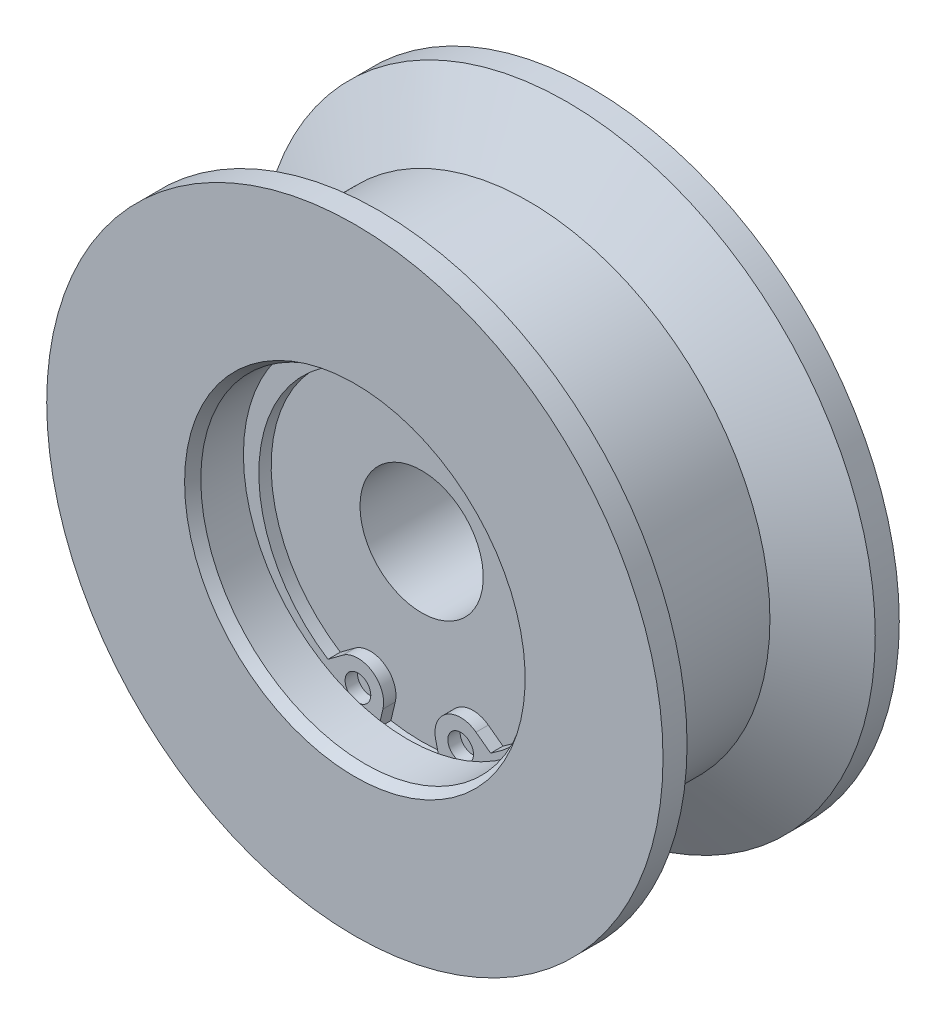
ISO-10303-21;
HEADER;
FILE_DESCRIPTION(('STEP AP214'),'2;1');
FILE_NAME('part.step','',(''),(''),'','','');
FILE_SCHEMA(('AUTOMOTIVE_DESIGN { 1 0 10303 214 1 1 1 1 }'));
ENDSEC;
DATA;
#1=APPLICATION_CONTEXT('core data for automotive mechanical design processes');
#2=APPLICATION_PROTOCOL_DEFINITION('international standard','automotive_design',2000,#1);
#3=PRODUCT_CONTEXT('',#1,'mechanical');
#4=PRODUCT('Part','Part','',(#3));
#5=PRODUCT_RELATED_PRODUCT_CATEGORY('part','',(#4));
#6=PRODUCT_DEFINITION_FORMATION('','',#4);
#7=PRODUCT_DEFINITION_CONTEXT('part definition',#1,'design');
#8=PRODUCT_DEFINITION('design','',#6,#7);
#9=PRODUCT_DEFINITION_SHAPE('','',#8);
#10=(LENGTH_UNIT() NAMED_UNIT(*) SI_UNIT(.MILLI.,.METRE.));
#11=(NAMED_UNIT(*) PLANE_ANGLE_UNIT() SI_UNIT($,.RADIAN.));
#12=(NAMED_UNIT(*) SI_UNIT($,.STERADIAN.) SOLID_ANGLE_UNIT());
#13=UNCERTAINTY_MEASURE_WITH_UNIT(LENGTH_MEASURE(1.E-05),#10,'distance_accuracy_value','');
#14=(GEOMETRIC_REPRESENTATION_CONTEXT(3) GLOBAL_UNCERTAINTY_ASSIGNED_CONTEXT((#13)) GLOBAL_UNIT_ASSIGNED_CONTEXT((#10,
#11,#12)) REPRESENTATION_CONTEXT('',''));
#15=CARTESIAN_POINT('',(0.,0.,0.));
#16=DIRECTION('',(0.,0.,1.));
#17=DIRECTION('',(1.,0.,0.));
#18=AXIS2_PLACEMENT_3D('',#15,#16,#17);
#19=CARTESIAN_POINT('',(0.,0.,-9.160254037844));
#20=DIRECTION('',(0.,0.,-1.));
#21=DIRECTION('',(1.,0.,0.));
#22=AXIS2_PLACEMENT_3D('',#19,#20,#21);
#23=CONICAL_SURFACE('',#22,29.9999999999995,1.04719755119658);
#24=CARTESIAN_POINT('',(0.,0.,-5.40747728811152));
#25=DIRECTION('',(0.,0.,1.));
#26=DIRECTION('',(-1.,0.,0.));
#27=AXIS2_PLACEMENT_3D('',#24,#25,#26);
#28=CIRCLE('',#27,23.5);
#29=CARTESIAN_POINT('',(-23.5,0.,-5.40747728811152));
#30=VERTEX_POINT('',#29);
#31=EDGE_CURVE('E185',#30,#30,#28,.T.);
#32=ORIENTED_EDGE('',*,*,#31,.F.);
#33=EDGE_LOOP('',(#32));
#34=FACE_BOUND('',#33,.T.);
#35=CARTESIAN_POINT('',(0.,0.,-9.160254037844));
#36=DIRECTION('',(0.,0.,1.));
#37=DIRECTION('',(-1.,0.,0.));
#38=AXIS2_PLACEMENT_3D('',#35,#36,#37);
#39=CIRCLE('',#38,29.9999999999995);
#40=CARTESIAN_POINT('',(-29.9999999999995,0.,-9.160254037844));
#41=VERTEX_POINT('',#40);
#42=EDGE_CURVE('E188',#41,#41,#39,.T.);
#43=ORIENTED_EDGE('',*,*,#42,.T.);
#44=EDGE_LOOP('',(#43));
#45=FACE_BOUND('',#44,.T.);
#46=ADVANCED_FACE('F14',(#34,#45),#23,.T.);
#47=CARTESIAN_POINT('',(0.,0.,18.7645339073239));
#48=DIRECTION('',(0.,0.,1.));
#49=DIRECTION('',(-1.,0.,0.));
#50=AXIS2_PLACEMENT_3D('',#47,#48,#49);
#51=CYLINDRICAL_SURFACE('',#50,23.5);
#52=CARTESIAN_POINT('',(0.,0.,5.407477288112));
#53=DIRECTION('',(0.,0.,1.));
#54=DIRECTION('',(-1.,0.,0.));
#55=AXIS2_PLACEMENT_3D('',#52,#53,#54);
#56=CIRCLE('',#55,23.5);
#57=CARTESIAN_POINT('',(-23.5,0.,5.407477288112));
#58=VERTEX_POINT('',#57);
#59=EDGE_CURVE('E182',#58,#58,#56,.T.);
#60=ORIENTED_EDGE('',*,*,#59,.F.);
#61=EDGE_LOOP('',(#60));
#62=FACE_BOUND('',#61,.T.);
#63=ORIENTED_EDGE('',*,*,#31,.T.);
#64=EDGE_LOOP('',(#63));
#65=FACE_BOUND('',#64,.T.);
#66=ADVANCED_FACE('F291',(#62,#65),#51,.T.);
#67=CARTESIAN_POINT('',(0.,0.,18.7645339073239));
#68=DIRECTION('',(0.,0.,1.));
#69=DIRECTION('',(-1.,0.,0.));
#70=AXIS2_PLACEMENT_3D('',#67,#68,#69);
#71=CYLINDRICAL_SURFACE('',#70,29.9999999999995);
#72=ORIENTED_EDGE('',*,*,#42,.F.);
#73=EDGE_LOOP('',(#72));
#74=FACE_BOUND('',#73,.T.);
#75=CARTESIAN_POINT('',(0.,0.,-11.5));
#76=DIRECTION('',(0.,0.,1.));
#77=DIRECTION('',(-1.,0.,0.));
#78=AXIS2_PLACEMENT_3D('',#75,#76,#77);
#79=CIRCLE('',#78,29.9999999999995);
#80=CARTESIAN_POINT('',(-29.9999999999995,0.,-11.5));
#81=VERTEX_POINT('',#80);
#82=EDGE_CURVE('E191',#81,#81,#79,.T.);
#83=ORIENTED_EDGE('',*,*,#82,.T.);
#84=EDGE_LOOP('',(#83));
#85=FACE_BOUND('',#84,.T.);
#86=ADVANCED_FACE('F289',(#74,#85),#71,.T.);
#87=CARTESIAN_POINT('',(0.,0.,5.407477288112));
#88=DIRECTION('',(0.,0.,1.));
#89=DIRECTION('',(-1.,0.,0.));
#90=AXIS2_PLACEMENT_3D('',#87,#88,#89);
#91=CONICAL_SURFACE('',#90,23.5,1.04719755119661);
#92=CARTESIAN_POINT('',(0.,0.,9.16025403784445));
#93=DIRECTION('',(0.,0.,1.));
#94=DIRECTION('',(-1.,0.,0.));
#95=AXIS2_PLACEMENT_3D('',#92,#93,#94);
#96=CIRCLE('',#95,30.);
#97=CARTESIAN_POINT('',(-30.,0.,9.16025403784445));
#98=VERTEX_POINT('',#97);
#99=EDGE_CURVE('E179',#98,#98,#96,.T.);
#100=ORIENTED_EDGE('',*,*,#99,.F.);
#101=EDGE_LOOP('',(#100));
#102=FACE_BOUND('',#101,.T.);
#103=ORIENTED_EDGE('',*,*,#59,.T.);
#104=EDGE_LOOP('',(#103));
#105=FACE_BOUND('',#104,.T.);
#106=ADVANCED_FACE('F286',(#102,#105),#91,.T.);
#107=CARTESIAN_POINT('',(0.,-13.,-11.5));
#108=DIRECTION('',(0.,0.,1.));
#109=DIRECTION('',(-1.,0.,0.));
#110=AXIS2_PLACEMENT_3D('',#107,#108,#109);
#111=PLANE('',#110);
#112=ORIENTED_EDGE('',*,*,#82,.F.);
#113=EDGE_LOOP('',(#112));
#114=FACE_BOUND('',#113,.T.);
#115=CARTESIAN_POINT('',(0.,0.,-11.5));
#116=DIRECTION('',(0.,0.,1.));
#117=DIRECTION('',(-1.,0.,0.));
#118=AXIS2_PLACEMENT_3D('',#115,#116,#117);
#119=CIRCLE('',#118,13.);
#120=CARTESIAN_POINT('',(-13.,0.,-11.5));
#121=VERTEX_POINT('',#120);
#122=EDGE_CURVE('E194',#121,#121,#119,.T.);
#123=ORIENTED_EDGE('',*,*,#122,.T.);
#124=EDGE_LOOP('',(#123));
#125=FACE_BOUND('',#124,.T.);
#126=ADVANCED_FACE('F284',(#114,#125),#111,.F.);
#127=CARTESIAN_POINT('',(0.,0.,18.7645339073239));
#128=DIRECTION('',(0.,0.,1.));
#129=DIRECTION('',(-1.,0.,0.));
#130=AXIS2_PLACEMENT_3D('',#127,#128,#129);
#131=CYLINDRICAL_SURFACE('',#130,30.);
#132=CARTESIAN_POINT('',(0.,0.,11.5));
#133=DIRECTION('',(0.,0.,1.));
#134=DIRECTION('',(-1.,0.,0.));
#135=AXIS2_PLACEMENT_3D('',#132,#133,#134);
#136=CIRCLE('',#135,30.);
#137=CARTESIAN_POINT('',(-30.,0.,11.5));
#138=VERTEX_POINT('',#137);
#139=EDGE_CURVE('E176',#138,#138,#136,.T.);
#140=ORIENTED_EDGE('',*,*,#139,.F.);
#141=EDGE_LOOP('',(#140));
#142=FACE_BOUND('',#141,.T.);
#143=ORIENTED_EDGE('',*,*,#99,.T.);
#144=EDGE_LOOP('',(#143));
#145=FACE_BOUND('',#144,.T.);
#146=ADVANCED_FACE('F281',(#142,#145),#131,.T.);
#147=CARTESIAN_POINT('',(0.,0.,18.7645339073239));
#148=DIRECTION('',(0.,0.,1.));
#149=DIRECTION('',(-1.,0.,0.));
#150=AXIS2_PLACEMENT_3D('',#147,#148,#149);
#151=CYLINDRICAL_SURFACE('',#150,13.);
#152=ORIENTED_EDGE('',*,*,#122,.F.);
#153=EDGE_LOOP('',(#152));
#154=FACE_BOUND('',#153,.T.);
#155=CARTESIAN_POINT('',(0.,0.,-5.));
#156=DIRECTION('',(0.,0.,1.));
#157=DIRECTION('',(-1.,0.,0.));
#158=AXIS2_PLACEMENT_3D('',#155,#156,#157);
#159=CIRCLE('',#158,13.);
#160=CARTESIAN_POINT('',(-13.,0.,-5.));
#161=VERTEX_POINT('',#160);
#162=EDGE_CURVE('E197',#161,#161,#159,.T.);
#163=ORIENTED_EDGE('',*,*,#162,.T.);
#164=EDGE_LOOP('',(#163));
#165=FACE_BOUND('',#164,.T.);
#166=ADVANCED_FACE('F279',(#154,#165),#151,.F.);
#167=CARTESIAN_POINT('',(0.,-16.5773502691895,11.5));
#168=DIRECTION('',(0.,0.,-1.));
#169=DIRECTION('',(1.,0.,0.));
#170=AXIS2_PLACEMENT_3D('',#167,#168,#169);
#171=PLANE('',#170);
#172=CARTESIAN_POINT('',(0.,0.,11.5));
#173=DIRECTION('',(0.,0.,1.));
#174=DIRECTION('',(-1.,0.,0.));
#175=AXIS2_PLACEMENT_3D('',#172,#173,#174);
#176=CIRCLE('',#175,16.5773502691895);
#177=CARTESIAN_POINT('',(-16.5773502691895,0.,11.5));
#178=VERTEX_POINT('',#177);
#179=EDGE_CURVE('E173',#178,#178,#176,.T.);
#180=ORIENTED_EDGE('',*,*,#179,.F.);
#181=EDGE_LOOP('',(#180));
#182=FACE_BOUND('',#181,.T.);
#183=ORIENTED_EDGE('',*,*,#139,.T.);
#184=EDGE_LOOP('',(#183));
#185=FACE_BOUND('',#184,.T.);
#186=ADVANCED_FACE('F276',(#182,#185),#171,.F.);
#187=CARTESIAN_POINT('',(0.,-13.,-5.));
#188=DIRECTION('',(0.,0.,1.));
#189=DIRECTION('',(-1.,0.,0.));
#190=AXIS2_PLACEMENT_3D('',#187,#188,#189);
#191=PLANE('',#190);
#192=ORIENTED_EDGE('',*,*,#162,.F.);
#193=EDGE_LOOP('',(#192));
#194=FACE_BOUND('',#193,.T.);
#195=CARTESIAN_POINT('',(0.,0.,-5.));
#196=DIRECTION('',(0.,0.,1.));
#197=DIRECTION('',(-1.,0.,0.));
#198=AXIS2_PLACEMENT_3D('',#195,#196,#197);
#199=CIRCLE('',#198,6.);
#200=CARTESIAN_POINT('',(-6.,0.,-5.));
#201=VERTEX_POINT('',#200);
#202=EDGE_CURVE('E200',#201,#201,#199,.T.);
#203=ORIENTED_EDGE('',*,*,#202,.T.);
#204=EDGE_LOOP('',(#203));
#205=FACE_BOUND('',#204,.T.);
#206=ADVANCED_FACE('F274',(#194,#205),#191,.F.);
#207=CARTESIAN_POINT('',(0.,0.,11.5));
#208=DIRECTION('',(0.,0.,1.));
#209=DIRECTION('',(-1.,0.,0.));
#210=AXIS2_PLACEMENT_3D('',#207,#208,#209);
#211=CONICAL_SURFACE('',#210,16.5773502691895,0.523598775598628);
#212=CARTESIAN_POINT('',(0.,0.,10.500000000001));
#213=DIRECTION('',(0.,0.,1.));
#214=DIRECTION('',(-1.,0.,0.));
#215=AXIS2_PLACEMENT_3D('',#212,#213,#214);
#216=CIRCLE('',#215,16.);
#217=CARTESIAN_POINT('',(-16.,0.,10.500000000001));
#218=VERTEX_POINT('',#217);
#219=EDGE_CURVE('E170',#218,#218,#216,.T.);
#220=ORIENTED_EDGE('',*,*,#219,.F.);
#221=EDGE_LOOP('',(#220));
#222=FACE_BOUND('',#221,.T.);
#223=ORIENTED_EDGE('',*,*,#179,.T.);
#224=EDGE_LOOP('',(#223));
#225=FACE_BOUND('',#224,.T.);
#226=ADVANCED_FACE('F271',(#222,#225),#211,.F.);
#227=CARTESIAN_POINT('',(0.,0.,18.7645339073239));
#228=DIRECTION('',(0.,0.,1.));
#229=DIRECTION('',(-1.,0.,0.));
#230=AXIS2_PLACEMENT_3D('',#227,#228,#229);
#231=CYLINDRICAL_SURFACE('',#230,6.);
#232=ORIENTED_EDGE('',*,*,#202,.F.);
#233=EDGE_LOOP('',(#232));
#234=FACE_BOUND('',#233,.T.);
#235=CARTESIAN_POINT('',(0.,0.,5.));
#236=DIRECTION('',(0.,0.,1.));
#237=DIRECTION('',(-1.,0.,0.));
#238=AXIS2_PLACEMENT_3D('',#235,#236,#237);
#239=CIRCLE('',#238,6.);
#240=CARTESIAN_POINT('',(-6.,0.,5.));
#241=VERTEX_POINT('',#240);
#242=EDGE_CURVE('E203',#241,#241,#239,.T.);
#243=ORIENTED_EDGE('',*,*,#242,.T.);
#244=EDGE_LOOP('',(#243));
#245=FACE_BOUND('',#244,.T.);
#246=ADVANCED_FACE('F270',(#234,#245),#231,.F.);
#247=CARTESIAN_POINT('',(0.,0.,18.7645339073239));
#248=DIRECTION('',(0.,0.,1.));
#249=DIRECTION('',(-1.,0.,0.));
#250=AXIS2_PLACEMENT_3D('',#247,#248,#249);
#251=CYLINDRICAL_SURFACE('',#250,16.);
#252=CARTESIAN_POINT('',(0.,0.,6.35));
#253=DIRECTION('',(0.,0.,1.));
#254=DIRECTION('',(1.,0.,0.));
#255=AXIS2_PLACEMENT_3D('',#252,#253,#254);
#256=CIRCLE('',#255,16.);
#257=CARTESIAN_POINT('',(16.,0.,6.35));
#258=VERTEX_POINT('',#257);
#259=EDGE_CURVE('E18',#258,#258,#256,.F.);
#260=ORIENTED_EDGE('',*,*,#259,.T.);
#261=EDGE_LOOP('',(#260));
#262=FACE_BOUND('',#261,.T.);
#263=ORIENTED_EDGE('',*,*,#219,.T.);
#264=EDGE_LOOP('',(#263));
#265=FACE_BOUND('',#264,.T.);
#266=ADVANCED_FACE('F217',(#262,#265),#251,.F.);
#267=CARTESIAN_POINT('',(0.,-14.500431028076,5.));
#268=DIRECTION('',(0.,0.,-1.));
#269=DIRECTION('',(1.,0.,0.));
#270=AXIS2_PLACEMENT_3D('',#267,#268,#269);
#271=PLANE('',#270);
#272=ORIENTED_EDGE('',*,*,#242,.F.);
#273=EDGE_LOOP('',(#272));
#274=FACE_BOUND('',#273,.T.);
#275=DIRECTION('',(0.231349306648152,-0.972870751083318,0.));
#276=VECTOR('',#275,1.);
#277=CARTESIAN_POINT('',(2.36256803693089,-13.9386107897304,5.));
#278=LINE('',#277,#276);
#279=CARTESIAN_POINT('',(2.56782312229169,-14.8017500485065,5.));
#280=VERTEX_POINT('',#279);
#281=CARTESIAN_POINT('',(2.99125499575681,-16.5823669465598,5.));
#282=VERTEX_POINT('',#281);
#283=EDGE_CURVE('E9',#280,#282,#278,.T.);
#284=ORIENTED_EDGE('',*,*,#283,.F.);
#285=CARTESIAN_POINT('',(5.,-14.2233767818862,5.));
#286=DIRECTION('',(0.,0.,-1.));
#287=DIRECTION('',(-1.,0.,0.));
#288=AXIS2_PLACEMENT_3D('',#285,#286,#287);
#289=CIRCLE('',#288,2.5);
#290=CARTESIAN_POINT('',(6.49138441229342,-12.2169439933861,5.));
#291=VERTEX_POINT('',#290);
#292=EDGE_CURVE('E25',#280,#291,#289,.T.);
#293=ORIENTED_EDGE('',*,*,#292,.T.);
#294=DIRECTION('',(-0.802573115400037,0.596553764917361,0.));
#295=VECTOR('',#294,1.);
#296=CARTESIAN_POINT('',(3.4034138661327,-9.92165099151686,5.));
#297=LINE('',#296,#295);
#298=CARTESIAN_POINT('',(7.91695293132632,-13.2765711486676,5.));
#299=VERTEX_POINT('',#298);
#300=EDGE_CURVE('E73',#299,#291,#297,.T.);
#301=ORIENTED_EDGE('',*,*,#300,.F.);
#302=CARTESIAN_POINT('',(0.,-0.95,5.));
#303=DIRECTION('',(0.,0.,-1.));
#304=DIRECTION('',(-1.,0.,0.));
#305=AXIS2_PLACEMENT_3D('',#302,#303,#304);
#306=CIRCLE('',#305,14.65);
#307=CARTESIAN_POINT('',(-7.91695293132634,-13.2765711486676,5.));
#308=VERTEX_POINT('',#307);
#309=EDGE_CURVE('E126',#308,#299,#306,.T.);
#310=ORIENTED_EDGE('',*,*,#309,.F.);
#311=DIRECTION('',(-0.802573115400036,-0.596553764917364,0.));
#312=VECTOR('',#311,1.);
#313=CARTESIAN_POINT('',(-3.40341386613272,-9.92165099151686,5.));
#314=LINE('',#313,#312);
#315=CARTESIAN_POINT('',(-6.49138441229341,-12.2169439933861,5.));
#316=VERTEX_POINT('',#315);
#317=EDGE_CURVE('E130',#316,#308,#314,.T.);
#318=ORIENTED_EDGE('',*,*,#317,.F.);
#319=CARTESIAN_POINT('',(-5.,-14.2233767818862,5.));
#320=DIRECTION('',(0.,0.,-1.));
#321=DIRECTION('',(-1.,0.,0.));
#322=AXIS2_PLACEMENT_3D('',#319,#320,#321);
#323=CIRCLE('',#322,2.5);
#324=CARTESIAN_POINT('',(-2.56782312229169,-14.8017500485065,5.));
#325=VERTEX_POINT('',#324);
#326=EDGE_CURVE('E137',#316,#325,#323,.T.);
#327=ORIENTED_EDGE('',*,*,#326,.T.);
#328=DIRECTION('',(0.231349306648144,0.97287075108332,0.));
#329=VECTOR('',#328,1.);
#330=CARTESIAN_POINT('',(-2.36256803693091,-13.9386107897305,5.));
#331=LINE('',#330,#329);
#332=CARTESIAN_POINT('',(-2.9912549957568,-16.5823669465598,5.));
#333=VERTEX_POINT('',#332);
#334=EDGE_CURVE('E134',#333,#325,#331,.T.);
#335=ORIENTED_EDGE('',*,*,#334,.F.);
#336=CARTESIAN_POINT('',(0.,0.,5.));
#337=DIRECTION('',(0.,0.,1.));
#338=DIRECTION('',(1.,0.,0.));
#339=AXIS2_PLACEMENT_3D('',#336,#337,#338);
#340=CIRCLE('',#339,16.85);
#341=EDGE_CURVE('E103',#333,#282,#340,.T.);
#342=ORIENTED_EDGE('',*,*,#341,.T.);
#343=EDGE_LOOP('',(#284,#293,#301,#310,#318,#327,#335,#342));
#344=FACE_BOUND('',#343,.T.);
#345=ADVANCED_FACE('F239',(#274,#344),#271,.F.);
#346=CARTESIAN_POINT('',(0.,0.,5.));
#347=DIRECTION('',(0.,0.,1.));
#348=DIRECTION('',(1.,0.,0.));
#349=AXIS2_PLACEMENT_3D('',#346,#347,#348);
#350=CYLINDRICAL_SURFACE('',#349,16.85);
#351=DIRECTION('',(0.,0.,1.));
#352=VECTOR('',#351,1.);
#353=CARTESIAN_POINT('',(2.99125499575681,-16.5823669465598,5.));
#354=LINE('',#353,#352);
#355=CARTESIAN_POINT('',(2.99125499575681,-16.5823669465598,6.2));
#356=VERTEX_POINT('',#355);
#357=EDGE_CURVE('E164',#282,#356,#354,.T.);
#358=ORIENTED_EDGE('',*,*,#357,.F.);
#359=ORIENTED_EDGE('',*,*,#341,.F.);
#360=DIRECTION('',(0.,0.,1.));
#361=VECTOR('',#360,1.);
#362=CARTESIAN_POINT('',(-2.99125499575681,-16.5823669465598,5.));
#363=LINE('',#362,#361);
#364=CARTESIAN_POINT('',(-2.99125499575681,-16.5823669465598,6.2));
#365=VERTEX_POINT('',#364);
#366=EDGE_CURVE('E167',#365,#333,#363,.F.);
#367=ORIENTED_EDGE('',*,*,#366,.F.);
#368=CARTESIAN_POINT('',(0.,0.,6.2));
#369=DIRECTION('',(0.,0.,1.));
#370=DIRECTION('',(1.,0.,0.));
#371=AXIS2_PLACEMENT_3D('',#368,#369,#370);
#372=CIRCLE('',#371,16.85);
#373=EDGE_CURVE('E207',#356,#365,#372,.T.);
#374=ORIENTED_EDGE('',*,*,#373,.F.);
#375=EDGE_LOOP('',(#358,#359,#367,#374));
#376=FACE_BOUND('',#375,.T.);
#377=CARTESIAN_POINT('',(0.,0.,6.35));
#378=DIRECTION('',(0.,0.,1.));
#379=DIRECTION('',(1.,0.,0.));
#380=AXIS2_PLACEMENT_3D('',#377,#378,#379);
#381=CIRCLE('',#380,16.85);
#382=CARTESIAN_POINT('',(16.85,0.,6.35));
#383=VERTEX_POINT('',#382);
#384=EDGE_CURVE('E210',#383,#383,#381,.T.);
#385=ORIENTED_EDGE('',*,*,#384,.T.);
#386=EDGE_LOOP('',(#385));
#387=FACE_BOUND('',#386,.T.);
#388=ADVANCED_FACE('F313',(#376,#387),#350,.F.);
#389=CARTESIAN_POINT('',(5.,-14.2233767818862,5.));
#390=DIRECTION('',(0.,0.,-1.));
#391=DIRECTION('',(-1.,0.,0.));
#392=AXIS2_PLACEMENT_3D('',#389,#390,#391);
#393=CIRCLE('',#392,1.25);
#394=CARTESIAN_POINT('',(3.75,-14.2233767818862,5.));
#395=VERTEX_POINT('',#394);
#396=EDGE_CURVE('E145',#395,#395,#393,.T.);
#397=ORIENTED_EDGE('',*,*,#396,.F.);
#398=EDGE_LOOP('',(#397));
#399=FACE_BOUND('',#398,.T.);
#400=ADVANCED_FACE('F236',(#399),#271,.F.);
#401=CARTESIAN_POINT('',(-5.,-14.2233767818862,5.));
#402=DIRECTION('',(0.,0.,-1.));
#403=DIRECTION('',(-1.,0.,0.));
#404=AXIS2_PLACEMENT_3D('',#401,#402,#403);
#405=CIRCLE('',#404,1.25);
#406=CARTESIAN_POINT('',(-6.25,-14.2233767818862,5.));
#407=VERTEX_POINT('',#406);
#408=EDGE_CURVE('E141',#407,#407,#405,.T.);
#409=ORIENTED_EDGE('',*,*,#408,.F.);
#410=EDGE_LOOP('',(#409));
#411=FACE_BOUND('',#410,.T.);
#412=ADVANCED_FACE('F225',(#411),#271,.F.);
#413=CARTESIAN_POINT('',(0.,-0.95,6.2));
#414=DIRECTION('',(0.,0.,1.));
#415=DIRECTION('',(-1.,0.,0.));
#416=AXIS2_PLACEMENT_3D('',#413,#414,#415);
#417=CYLINDRICAL_SURFACE('',#416,14.65);
#418=ORIENTED_EDGE('',*,*,#309,.T.);
#419=DIRECTION('',(0.,0.,-1.));
#420=VECTOR('',#419,1.);
#421=CARTESIAN_POINT('',(7.91695293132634,-13.2765711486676,6.2));
#422=LINE('',#421,#420);
#423=CARTESIAN_POINT('',(7.91695293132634,-13.2765711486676,6.2));
#424=VERTEX_POINT('',#423);
#425=EDGE_CURVE('E108',#424,#299,#422,.T.);
#426=ORIENTED_EDGE('',*,*,#425,.F.);
#427=CARTESIAN_POINT('',(0.,-0.95,6.2));
#428=DIRECTION('',(0.,0.,-1.));
#429=DIRECTION('',(0.,-1.,0.));
#430=AXIS2_PLACEMENT_3D('',#427,#428,#429);
#431=CIRCLE('',#430,14.65);
#432=CARTESIAN_POINT('',(-7.91695293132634,-13.2765711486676,6.2));
#433=VERTEX_POINT('',#432);
#434=EDGE_CURVE('E88',#433,#424,#431,.T.);
#435=ORIENTED_EDGE('',*,*,#434,.F.);
#436=DIRECTION('',(0.,0.,-1.));
#437=VECTOR('',#436,1.);
#438=CARTESIAN_POINT('',(-7.91695293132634,-13.2765711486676,6.2));
#439=LINE('',#438,#437);
#440=EDGE_CURVE('E104',#433,#308,#439,.T.);
#441=ORIENTED_EDGE('',*,*,#440,.T.);
#442=EDGE_LOOP('',(#418,#426,#435,#441));
#443=FACE_BOUND('',#442,.T.);
#444=ADVANCED_FACE('F235',(#443),#417,.F.);
#445=CARTESIAN_POINT('',(6.49138441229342,-12.2169439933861,6.2));
#446=DIRECTION('',(-0.596553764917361,-0.802573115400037,0.));
#447=DIRECTION('',(-0.802573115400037,0.596553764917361,0.));
#448=AXIS2_PLACEMENT_3D('',#445,#446,#447);
#449=PLANE('',#448);
#450=ORIENTED_EDGE('',*,*,#300,.T.);
#451=DIRECTION('',(0.,0.,-1.));
#452=VECTOR('',#451,1.);
#453=CARTESIAN_POINT('',(6.49138441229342,-12.2169439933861,6.2));
#454=LINE('',#453,#452);
#455=CARTESIAN_POINT('',(6.49138441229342,-12.2169439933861,6.2));
#456=VERTEX_POINT('',#455);
#457=EDGE_CURVE('E67',#456,#291,#454,.T.);
#458=ORIENTED_EDGE('',*,*,#457,.F.);
#459=DIRECTION('',(-0.802573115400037,0.596553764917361,0.));
#460=VECTOR('',#459,1.);
#461=CARTESIAN_POINT('',(6.49138441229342,-12.2169439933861,6.2));
#462=LINE('',#461,#460);
#463=EDGE_CURVE('E71',#424,#456,#462,.T.);
#464=ORIENTED_EDGE('',*,*,#463,.F.);
#465=ORIENTED_EDGE('',*,*,#425,.T.);
#466=EDGE_LOOP('',(#450,#458,#464,#465));
#467=FACE_BOUND('',#466,.T.);
#468=ADVANCED_FACE('F69',(#467),#449,.F.);
#469=CARTESIAN_POINT('',(-6.49138441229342,-12.2169439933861,6.2));
#470=DIRECTION('',(0.596553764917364,-0.802573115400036,0.));
#471=DIRECTION('',(0.,0.,-1.));
#472=AXIS2_PLACEMENT_3D('',#469,#470,#471);
#473=PLANE('',#472);
#474=ORIENTED_EDGE('',*,*,#317,.T.);
#475=ORIENTED_EDGE('',*,*,#440,.F.);
#476=DIRECTION('',(-0.802573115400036,-0.596553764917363,0.));
#477=VECTOR('',#476,1.);
#478=CARTESIAN_POINT('',(-6.49138441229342,-12.2169439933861,6.2));
#479=LINE('',#478,#477);
#480=CARTESIAN_POINT('',(-6.49138441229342,-12.2169439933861,6.2));
#481=VERTEX_POINT('',#480);
#482=EDGE_CURVE('E107',#481,#433,#479,.T.);
#483=ORIENTED_EDGE('',*,*,#482,.F.);
#484=DIRECTION('',(0.,0.,-1.));
#485=VECTOR('',#484,1.);
#486=CARTESIAN_POINT('',(-6.49138441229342,-12.2169439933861,6.2));
#487=LINE('',#486,#485);
#488=EDGE_CURVE('E99',#481,#316,#487,.T.);
#489=ORIENTED_EDGE('',*,*,#488,.T.);
#490=EDGE_LOOP('',(#474,#475,#483,#489));
#491=FACE_BOUND('',#490,.T.);
#492=ADVANCED_FACE('F245',(#491),#473,.F.);
#493=CARTESIAN_POINT('',(5.,-14.2233767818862,6.2));
#494=DIRECTION('',(0.,0.,1.));
#495=DIRECTION('',(-1.,0.,0.));
#496=AXIS2_PLACEMENT_3D('',#493,#494,#495);
#497=CYLINDRICAL_SURFACE('',#496,2.5);
#498=ORIENTED_EDGE('',*,*,#292,.F.);
#499=DIRECTION('',(0.,0.,-1.));
#500=VECTOR('',#499,1.);
#501=CARTESIAN_POINT('',(2.5678231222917,-14.8017500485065,6.2));
#502=LINE('',#501,#500);
#503=CARTESIAN_POINT('',(2.5678231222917,-14.8017500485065,6.2));
#504=VERTEX_POINT('',#503);
#505=EDGE_CURVE('E78',#504,#280,#502,.T.);
#506=ORIENTED_EDGE('',*,*,#505,.F.);
#507=CARTESIAN_POINT('',(5.,-14.2233767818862,6.2));
#508=DIRECTION('',(0.,0.,1.));
#509=DIRECTION('',(1.,0.,0.));
#510=AXIS2_PLACEMENT_3D('',#507,#508,#509);
#511=CIRCLE('',#510,2.5);
#512=EDGE_CURVE('E85',#456,#504,#511,.T.);
#513=ORIENTED_EDGE('',*,*,#512,.F.);
#514=ORIENTED_EDGE('',*,*,#457,.T.);
#515=EDGE_LOOP('',(#498,#506,#513,#514));
#516=FACE_BOUND('',#515,.T.);
#517=ADVANCED_FACE('F16',(#516),#497,.T.);
#518=CARTESIAN_POINT('',(0.,-0.95,6.2));
#519=DIRECTION('',(0.,0.,-1.));
#520=DIRECTION('',(0.,-1.,0.));
#521=AXIS2_PLACEMENT_3D('',#518,#519,#520);
#522=PLANE('',#521);
#523=ORIENTED_EDGE('',*,*,#512,.T.);
#524=DIRECTION('',(-0.231349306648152,0.972870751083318,0.));
#525=VECTOR('',#524,1.);
#526=CARTESIAN_POINT('',(-0.901087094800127,-0.214279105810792,6.2));
#527=LINE('',#526,#525);
#528=EDGE_CURVE('E149',#356,#504,#527,.T.);
#529=ORIENTED_EDGE('',*,*,#528,.F.);
#530=ORIENTED_EDGE('',*,*,#373,.T.);
#531=DIRECTION('',(-0.231349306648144,-0.97287075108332,0.));
#532=VECTOR('',#531,1.);
#533=CARTESIAN_POINT('',(0.901087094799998,-0.214279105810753,6.2));
#534=LINE('',#533,#532);
#535=CARTESIAN_POINT('',(-2.56782312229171,-14.8017500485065,6.2));
#536=VERTEX_POINT('',#535);
#537=EDGE_CURVE('E152',#536,#365,#534,.T.);
#538=ORIENTED_EDGE('',*,*,#537,.F.);
#539=CARTESIAN_POINT('',(-5.,-14.2233767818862,6.2));
#540=DIRECTION('',(0.,0.,1.));
#541=DIRECTION('',(-1.,0.,0.));
#542=AXIS2_PLACEMENT_3D('',#539,#540,#541);
#543=CIRCLE('',#542,2.5);
#544=EDGE_CURVE('E77',#536,#481,#543,.T.);
#545=ORIENTED_EDGE('',*,*,#544,.T.);
#546=ORIENTED_EDGE('',*,*,#482,.T.);
#547=ORIENTED_EDGE('',*,*,#434,.T.);
#548=ORIENTED_EDGE('',*,*,#463,.T.);
#549=EDGE_LOOP('',(#523,#529,#530,#538,#545,#546,#547,#548));
#550=FACE_BOUND('',#549,.T.);
#551=CARTESIAN_POINT('',(-5.,-14.2233767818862,6.2));
#552=DIRECTION('',(0.,0.,1.));
#553=DIRECTION('',(1.,0.,0.));
#554=AXIS2_PLACEMENT_3D('',#551,#552,#553);
#555=CIRCLE('',#554,1.25);
#556=CARTESIAN_POINT('',(-3.75,-14.2233767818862,6.2));
#557=VERTEX_POINT('',#556);
#558=EDGE_CURVE('E156',#557,#557,#555,.T.);
#559=ORIENTED_EDGE('',*,*,#558,.F.);
#560=EDGE_LOOP('',(#559));
#561=FACE_BOUND('',#560,.T.);
#562=CARTESIAN_POINT('',(5.,-14.2233767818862,6.2));
#563=DIRECTION('',(0.,0.,1.));
#564=DIRECTION('',(1.,0.,0.));
#565=AXIS2_PLACEMENT_3D('',#562,#563,#564);
#566=CIRCLE('',#565,1.25);
#567=CARTESIAN_POINT('',(6.25,-14.2233767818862,6.2));
#568=VERTEX_POINT('',#567);
#569=EDGE_CURVE('E160',#568,#568,#566,.T.);
#570=ORIENTED_EDGE('',*,*,#569,.F.);
#571=EDGE_LOOP('',(#570));
#572=FACE_BOUND('',#571,.T.);
#573=ADVANCED_FACE('F82',(#550,#561,#572),#522,.F.);
#574=CARTESIAN_POINT('',(-5.,-14.2233767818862,6.2));
#575=DIRECTION('',(0.,0.,1.));
#576=DIRECTION('',(-1.,0.,0.));
#577=AXIS2_PLACEMENT_3D('',#574,#575,#576);
#578=CYLINDRICAL_SURFACE('',#577,2.5);
#579=ORIENTED_EDGE('',*,*,#326,.F.);
#580=ORIENTED_EDGE('',*,*,#488,.F.);
#581=ORIENTED_EDGE('',*,*,#544,.F.);
#582=DIRECTION('',(0.,0.,-1.));
#583=VECTOR('',#582,1.);
#584=CARTESIAN_POINT('',(-2.56782312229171,-14.8017500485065,6.2));
#585=LINE('',#584,#583);
#586=EDGE_CURVE('E111',#536,#325,#585,.T.);
#587=ORIENTED_EDGE('',*,*,#586,.T.);
#588=EDGE_LOOP('',(#579,#580,#581,#587));
#589=FACE_BOUND('',#588,.T.);
#590=ADVANCED_FACE('F256',(#589),#578,.T.);
#591=CARTESIAN_POINT('',(-2.56782312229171,-14.8017500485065,6.2));
#592=DIRECTION('',(-0.97287075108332,0.231349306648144,0.));
#593=DIRECTION('',(0.,0.,1.));
#594=AXIS2_PLACEMENT_3D('',#591,#592,#593);
#595=PLANE('',#594);
#596=ORIENTED_EDGE('',*,*,#537,.T.);
#597=ORIENTED_EDGE('',*,*,#366,.T.);
#598=ORIENTED_EDGE('',*,*,#334,.T.);
#599=ORIENTED_EDGE('',*,*,#586,.F.);
#600=EDGE_LOOP('',(#596,#597,#598,#599));
#601=FACE_BOUND('',#600,.T.);
#602=ADVANCED_FACE('F251',(#601),#595,.F.);
#603=CARTESIAN_POINT('',(2.5678231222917,-14.8017500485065,6.2));
#604=DIRECTION('',(0.972870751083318,0.231349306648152,0.));
#605=DIRECTION('',(0.,0.,-1.));
#606=AXIS2_PLACEMENT_3D('',#603,#604,#605);
#607=PLANE('',#606);
#608=ORIENTED_EDGE('',*,*,#283,.T.);
#609=ORIENTED_EDGE('',*,*,#357,.T.);
#610=ORIENTED_EDGE('',*,*,#528,.T.);
#611=ORIENTED_EDGE('',*,*,#505,.T.);
#612=EDGE_LOOP('',(#608,#609,#610,#611));
#613=FACE_BOUND('',#612,.T.);
#614=ADVANCED_FACE('F248',(#613),#607,.F.);
#615=CARTESIAN_POINT('',(5.,-14.2233767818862,6.2));
#616=DIRECTION('',(0.,0.,1.));
#617=DIRECTION('',(-1.,0.,0.));
#618=AXIS2_PLACEMENT_3D('',#615,#616,#617);
#619=CYLINDRICAL_SURFACE('',#618,1.25);
#620=ORIENTED_EDGE('',*,*,#396,.T.);
#621=EDGE_LOOP('',(#620));
#622=FACE_BOUND('',#621,.T.);
#623=ORIENTED_EDGE('',*,*,#569,.T.);
#624=EDGE_LOOP('',(#623));
#625=FACE_BOUND('',#624,.T.);
#626=ADVANCED_FACE('F230',(#622,#625),#619,.F.);
#627=CARTESIAN_POINT('',(-5.,-14.2233767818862,6.2));
#628=DIRECTION('',(0.,0.,1.));
#629=DIRECTION('',(-1.,0.,0.));
#630=AXIS2_PLACEMENT_3D('',#627,#628,#629);
#631=CYLINDRICAL_SURFACE('',#630,1.25);
#632=ORIENTED_EDGE('',*,*,#408,.T.);
#633=EDGE_LOOP('',(#632));
#634=FACE_BOUND('',#633,.T.);
#635=ORIENTED_EDGE('',*,*,#558,.T.);
#636=EDGE_LOOP('',(#635));
#637=FACE_BOUND('',#636,.T.);
#638=ADVANCED_FACE('F222',(#634,#637),#631,.F.);
#639=CARTESIAN_POINT('',(0.,0.,6.35));
#640=DIRECTION('',(0.,0.,1.));
#641=DIRECTION('',(1.,0.,0.));
#642=AXIS2_PLACEMENT_3D('',#639,#640,#641);
#643=PLANE('',#642);
#644=ORIENTED_EDGE('',*,*,#384,.F.);
#645=EDGE_LOOP('',(#644));
#646=FACE_BOUND('',#645,.T.);
#647=ORIENTED_EDGE('',*,*,#259,.F.);
#648=EDGE_LOOP('',(#647));
#649=FACE_BOUND('',#648,.T.);
#650=ADVANCED_FACE('F220',(#646,#649),#643,.F.);
#651=CLOSED_SHELL('',(#46,#66,#86,#106,#126,#146,#166,#186,#206,#226,#246,#266,#345,#388,#400,
#412,#444,#468,#492,#517,#573,#590,#602,#614,#626,#638,#650));
#652=MANIFOLD_SOLID_BREP('B1',#651);
#653=ADVANCED_BREP_SHAPE_REPRESENTATION('',(#18,#652),#14);
#654=SHAPE_DEFINITION_REPRESENTATION(#9,#653);
ENDSEC;
END-ISO-10303-21;
